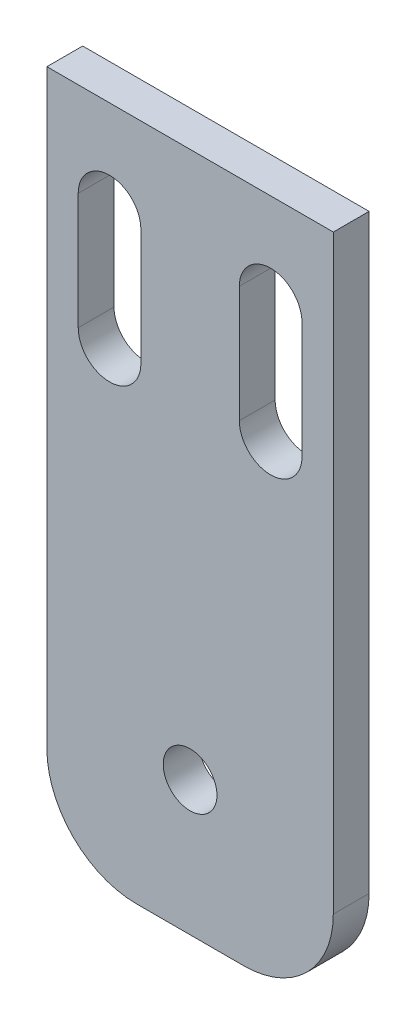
ISO-10303-21;
HEADER;
FILE_DESCRIPTION(('STEP AP214'),'2;1');
FILE_NAME('part.step','',(''),(''),'','','');
FILE_SCHEMA(('AUTOMOTIVE_DESIGN { 1 0 10303 214 1 1 1 1 }'));
ENDSEC;
DATA;
#1=APPLICATION_CONTEXT('core data for automotive mechanical design processes');
#2=APPLICATION_PROTOCOL_DEFINITION('international standard','automotive_design',2000,#1);
#3=PRODUCT_CONTEXT('',#1,'mechanical');
#4=PRODUCT('Part','Part','',(#3));
#5=PRODUCT_RELATED_PRODUCT_CATEGORY('part','',(#4));
#6=PRODUCT_DEFINITION_FORMATION('','',#4);
#7=PRODUCT_DEFINITION_CONTEXT('part definition',#1,'design');
#8=PRODUCT_DEFINITION('design','',#6,#7);
#9=PRODUCT_DEFINITION_SHAPE('','',#8);
#10=(LENGTH_UNIT() NAMED_UNIT(*) SI_UNIT(.MILLI.,.METRE.));
#11=(NAMED_UNIT(*) PLANE_ANGLE_UNIT() SI_UNIT($,.RADIAN.));
#12=(NAMED_UNIT(*) SI_UNIT($,.STERADIAN.) SOLID_ANGLE_UNIT());
#13=UNCERTAINTY_MEASURE_WITH_UNIT(LENGTH_MEASURE(1.E-05),#10,'distance_accuracy_value','');
#14=(GEOMETRIC_REPRESENTATION_CONTEXT(3) GLOBAL_UNCERTAINTY_ASSIGNED_CONTEXT((#13)) GLOBAL_UNIT_ASSIGNED_CONTEXT((#10,
#11,#12)) REPRESENTATION_CONTEXT('',''));
#15=CARTESIAN_POINT('',(0.,0.,0.));
#16=DIRECTION('',(0.,0.,1.));
#17=DIRECTION('',(1.,0.,0.));
#18=AXIS2_PLACEMENT_3D('',#15,#16,#17);
#19=CARTESIAN_POINT('',(0.,0.,0.));
#20=DIRECTION('',(0.,0.,1.));
#21=DIRECTION('',(1.,0.,0.));
#22=AXIS2_PLACEMENT_3D('',#19,#20,#21);
#23=PLANE('',#22);
#24=CARTESIAN_POINT('',(-3.04760792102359,-53.5,0.));
#25=DIRECTION('',(0.,0.,1.));
#26=DIRECTION('',(1.,0.,0.));
#27=AXIS2_PLACEMENT_3D('',#24,#25,#26);
#28=CIRCLE('',#27,1.49999999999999);
#29=CARTESIAN_POINT('',(-1.5476079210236,-53.5,0.));
#30=VERTEX_POINT('',#29);
#31=EDGE_CURVE('E179',#30,#30,#28,.T.);
#32=ORIENTED_EDGE('',*,*,#31,.F.);
#33=EDGE_LOOP('',(#32));
#34=FACE_BOUND('',#33,.T.);
#35=DIRECTION('',(0.,-1.,0.));
#36=VECTOR('',#35,1.);
#37=CARTESIAN_POINT('',(-11.0476079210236,-23.,0.));
#38=LINE('',#37,#36);
#39=CARTESIAN_POINT('',(-11.0476079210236,-23.,0.));
#40=VERTEX_POINT('',#39);
#41=CARTESIAN_POINT('',(-11.0476079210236,-56.,0.));
#42=VERTEX_POINT('',#41);
#43=EDGE_CURVE('E185',#40,#42,#38,.T.);
#44=ORIENTED_EDGE('',*,*,#43,.T.);
#45=CARTESIAN_POINT('',(-6.04760792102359,-56.,0.));
#46=DIRECTION('',(0.,0.,1.));
#47=DIRECTION('',(1.,0.,0.));
#48=AXIS2_PLACEMENT_3D('',#45,#46,#47);
#49=CIRCLE('',#48,5.);
#50=CARTESIAN_POINT('',(-6.04760792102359,-61.,0.));
#51=VERTEX_POINT('',#50);
#52=EDGE_CURVE('E217',#42,#51,#49,.T.);
#53=ORIENTED_EDGE('',*,*,#52,.T.);
#54=DIRECTION('',(1.,0.,0.));
#55=VECTOR('',#54,1.);
#56=CARTESIAN_POINT('',(-11.0476079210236,-61.,0.));
#57=LINE('',#56,#55);
#58=CARTESIAN_POINT('',(-0.0476079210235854,-61.,0.));
#59=VERTEX_POINT('',#58);
#60=EDGE_CURVE('E201',#51,#59,#57,.T.);
#61=ORIENTED_EDGE('',*,*,#60,.T.);
#62=CARTESIAN_POINT('',(-0.0476079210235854,-56.,0.));
#63=DIRECTION('',(0.,0.,1.));
#64=DIRECTION('',(1.,0.,0.));
#65=AXIS2_PLACEMENT_3D('',#62,#63,#64);
#66=CIRCLE('',#65,5.);
#67=CARTESIAN_POINT('',(4.95239207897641,-56.,0.));
#68=VERTEX_POINT('',#67);
#69=EDGE_CURVE('E215',#59,#68,#66,.T.);
#70=ORIENTED_EDGE('',*,*,#69,.T.);
#71=DIRECTION('',(0.,1.,0.));
#72=VECTOR('',#71,1.);
#73=CARTESIAN_POINT('',(4.95239207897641,-23.,0.));
#74=LINE('',#73,#72);
#75=CARTESIAN_POINT('',(4.95239207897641,-23.,0.));
#76=VERTEX_POINT('',#75);
#77=EDGE_CURVE('E204',#68,#76,#74,.T.);
#78=ORIENTED_EDGE('',*,*,#77,.T.);
#79=DIRECTION('',(-1.,0.,0.));
#80=VECTOR('',#79,1.);
#81=CARTESIAN_POINT('',(-11.0476079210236,-23.,0.));
#82=LINE('',#81,#80);
#83=EDGE_CURVE('E190',#76,#40,#82,.T.);
#84=ORIENTED_EDGE('',*,*,#83,.T.);
#85=EDGE_LOOP('',(#44,#53,#61,#70,#78,#84));
#86=FACE_BOUND('',#85,.T.);
#87=CARTESIAN_POINT('',(1.45239207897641,-28.25,0.));
#88=DIRECTION('',(0.,0.,1.));
#89=DIRECTION('',(1.,0.,0.));
#90=AXIS2_PLACEMENT_3D('',#87,#88,#89);
#91=CIRCLE('',#90,1.75);
#92=CARTESIAN_POINT('',(3.20239207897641,-28.25,0.));
#93=VERTEX_POINT('',#92);
#94=CARTESIAN_POINT('',(-0.297607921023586,-28.25,0.));
#95=VERTEX_POINT('',#94);
#96=EDGE_CURVE('E161',#93,#95,#91,.T.);
#97=ORIENTED_EDGE('',*,*,#96,.F.);
#98=DIRECTION('',(0.,-1.,0.));
#99=VECTOR('',#98,1.);
#100=CARTESIAN_POINT('',(3.20239207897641,-28.25,0.));
#101=LINE('',#100,#99);
#102=CARTESIAN_POINT('',(3.20239207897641,-34.75,0.));
#103=VERTEX_POINT('',#102);
#104=EDGE_CURVE('E155',#93,#103,#101,.T.);
#105=ORIENTED_EDGE('',*,*,#104,.T.);
#106=CARTESIAN_POINT('',(1.45239207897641,-34.75,0.));
#107=DIRECTION('',(0.,0.,1.));
#108=DIRECTION('',(1.,0.,0.));
#109=AXIS2_PLACEMENT_3D('',#106,#107,#108);
#110=CIRCLE('',#109,1.75);
#111=CARTESIAN_POINT('',(-0.297607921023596,-34.75,0.));
#112=VERTEX_POINT('',#111);
#113=EDGE_CURVE('E171',#112,#103,#110,.T.);
#114=ORIENTED_EDGE('',*,*,#113,.F.);
#115=DIRECTION('',(0.,-1.,0.));
#116=VECTOR('',#115,1.);
#117=CARTESIAN_POINT('',(-0.297607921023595,-28.25,0.));
#118=LINE('',#117,#116);
#119=EDGE_CURVE('E147',#95,#112,#118,.T.);
#120=ORIENTED_EDGE('',*,*,#119,.F.);
#121=EDGE_LOOP('',(#97,#105,#114,#120));
#122=FACE_BOUND('',#121,.T.);
#123=CARTESIAN_POINT('',(-7.54760792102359,-28.25,0.));
#124=DIRECTION('',(0.,0.,1.));
#125=DIRECTION('',(1.,0.,0.));
#126=AXIS2_PLACEMENT_3D('',#123,#124,#125);
#127=CIRCLE('',#126,1.75);
#128=CARTESIAN_POINT('',(-5.79760792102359,-28.25,0.));
#129=VERTEX_POINT('',#128);
#130=CARTESIAN_POINT('',(-9.29760792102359,-28.25,0.));
#131=VERTEX_POINT('',#130);
#132=EDGE_CURVE('E39',#129,#131,#127,.T.);
#133=ORIENTED_EDGE('',*,*,#132,.F.);
#134=DIRECTION('',(0.,-1.,0.));
#135=VECTOR('',#134,1.);
#136=CARTESIAN_POINT('',(-5.79760792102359,-28.25,0.));
#137=LINE('',#136,#135);
#138=CARTESIAN_POINT('',(-5.79760792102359,-34.75,0.));
#139=VERTEX_POINT('',#138);
#140=EDGE_CURVE('E120',#129,#139,#137,.T.);
#141=ORIENTED_EDGE('',*,*,#140,.T.);
#142=CARTESIAN_POINT('',(-7.54760792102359,-34.75,0.));
#143=DIRECTION('',(0.,0.,1.));
#144=DIRECTION('',(1.,0.,0.));
#145=AXIS2_PLACEMENT_3D('',#142,#143,#144);
#146=CIRCLE('',#145,1.75);
#147=CARTESIAN_POINT('',(-9.29760792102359,-34.75,0.));
#148=VERTEX_POINT('',#147);
#149=EDGE_CURVE('E142',#148,#139,#146,.T.);
#150=ORIENTED_EDGE('',*,*,#149,.F.);
#151=DIRECTION('',(0.,-1.,0.));
#152=VECTOR('',#151,1.);
#153=CARTESIAN_POINT('',(-9.29760792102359,-28.25,0.));
#154=LINE('',#153,#152);
#155=EDGE_CURVE('E135',#131,#148,#154,.T.);
#156=ORIENTED_EDGE('',*,*,#155,.F.);
#157=EDGE_LOOP('',(#133,#141,#150,#156));
#158=FACE_BOUND('',#157,.T.);
#159=ADVANCED_FACE('F16',(#34,#86,#122,#158),#23,.T.);
#160=CARTESIAN_POINT('',(0.,0.,-2.));
#161=DIRECTION('',(0.,0.,1.));
#162=DIRECTION('',(1.,0.,0.));
#163=AXIS2_PLACEMENT_3D('',#160,#161,#162);
#164=PLANE('',#163);
#165=DIRECTION('',(0.,-1.,0.));
#166=VECTOR('',#165,1.);
#167=CARTESIAN_POINT('',(-9.29760792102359,-28.25,-2.));
#168=LINE('',#167,#166);
#169=CARTESIAN_POINT('',(-9.29760792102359,-28.25,-2.));
#170=VERTEX_POINT('',#169);
#171=CARTESIAN_POINT('',(-9.29760792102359,-34.75,-2.));
#172=VERTEX_POINT('',#171);
#173=EDGE_CURVE('E311',#170,#172,#168,.T.);
#174=ORIENTED_EDGE('',*,*,#173,.T.);
#175=CARTESIAN_POINT('',(-7.54760792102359,-34.75,-2.));
#176=DIRECTION('',(0.,0.,1.));
#177=DIRECTION('',(1.,0.,0.));
#178=AXIS2_PLACEMENT_3D('',#175,#176,#177);
#179=CIRCLE('',#178,1.75);
#180=CARTESIAN_POINT('',(-5.79760792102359,-34.75,-2.));
#181=VERTEX_POINT('',#180);
#182=EDGE_CURVE('E31',#172,#181,#179,.T.);
#183=ORIENTED_EDGE('',*,*,#182,.T.);
#184=DIRECTION('',(0.,-1.,0.));
#185=VECTOR('',#184,1.);
#186=CARTESIAN_POINT('',(-5.79760792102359,-28.25,-2.));
#187=LINE('',#186,#185);
#188=CARTESIAN_POINT('',(-5.79760792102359,-28.25,-2.));
#189=VERTEX_POINT('',#188);
#190=EDGE_CURVE('E128',#189,#181,#187,.T.);
#191=ORIENTED_EDGE('',*,*,#190,.F.);
#192=CARTESIAN_POINT('',(-7.54760792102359,-28.25,-2.));
#193=DIRECTION('',(0.,0.,1.));
#194=DIRECTION('',(1.,0.,0.));
#195=AXIS2_PLACEMENT_3D('',#192,#193,#194);
#196=CIRCLE('',#195,1.75);
#197=EDGE_CURVE('E132',#189,#170,#196,.T.);
#198=ORIENTED_EDGE('',*,*,#197,.T.);
#199=EDGE_LOOP('',(#174,#183,#191,#198));
#200=FACE_BOUND('',#199,.T.);
#201=DIRECTION('',(1.,0.,0.));
#202=VECTOR('',#201,1.);
#203=CARTESIAN_POINT('',(-11.0476079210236,-61.,-2.));
#204=LINE('',#203,#202);
#205=CARTESIAN_POINT('',(-6.04760792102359,-61.,-2.));
#206=VERTEX_POINT('',#205);
#207=CARTESIAN_POINT('',(-0.0476079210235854,-61.,-2.));
#208=VERTEX_POINT('',#207);
#209=EDGE_CURVE('E189',#206,#208,#204,.T.);
#210=ORIENTED_EDGE('',*,*,#209,.F.);
#211=CARTESIAN_POINT('',(-6.04760792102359,-56.,-2.));
#212=DIRECTION('',(0.,0.,1.));
#213=DIRECTION('',(1.,0.,0.));
#214=AXIS2_PLACEMENT_3D('',#211,#212,#213);
#215=CIRCLE('',#214,5.);
#216=CARTESIAN_POINT('',(-11.0476079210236,-56.,-2.));
#217=VERTEX_POINT('',#216);
#218=EDGE_CURVE('E24',#206,#217,#215,.F.);
#219=ORIENTED_EDGE('',*,*,#218,.T.);
#220=DIRECTION('',(0.,-1.,0.));
#221=VECTOR('',#220,1.);
#222=CARTESIAN_POINT('',(-11.0476079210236,-23.,-2.));
#223=LINE('',#222,#221);
#224=CARTESIAN_POINT('',(-11.0476079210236,-23.,-2.));
#225=VERTEX_POINT('',#224);
#226=EDGE_CURVE('E186',#225,#217,#223,.T.);
#227=ORIENTED_EDGE('',*,*,#226,.F.);
#228=DIRECTION('',(-1.,0.,0.));
#229=VECTOR('',#228,1.);
#230=CARTESIAN_POINT('',(-11.0476079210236,-23.,-2.));
#231=LINE('',#230,#229);
#232=CARTESIAN_POINT('',(4.95239207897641,-23.,-2.));
#233=VERTEX_POINT('',#232);
#234=EDGE_CURVE('E195',#233,#225,#231,.T.);
#235=ORIENTED_EDGE('',*,*,#234,.F.);
#236=DIRECTION('',(0.,1.,0.));
#237=VECTOR('',#236,1.);
#238=CARTESIAN_POINT('',(4.95239207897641,-23.,-2.));
#239=LINE('',#238,#237);
#240=CARTESIAN_POINT('',(4.95239207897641,-56.,-2.));
#241=VERTEX_POINT('',#240);
#242=EDGE_CURVE('E193',#241,#233,#239,.T.);
#243=ORIENTED_EDGE('',*,*,#242,.F.);
#244=CARTESIAN_POINT('',(-0.0476079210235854,-56.,-2.));
#245=DIRECTION('',(0.,0.,1.));
#246=DIRECTION('',(1.,0.,0.));
#247=AXIS2_PLACEMENT_3D('',#244,#245,#246);
#248=CIRCLE('',#247,5.);
#249=EDGE_CURVE('E224',#241,#208,#248,.F.);
#250=ORIENTED_EDGE('',*,*,#249,.T.);
#251=EDGE_LOOP('',(#210,#219,#227,#235,#243,#250));
#252=FACE_BOUND('',#251,.T.);
#253=CARTESIAN_POINT('',(-3.04760792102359,-53.5,-2.));
#254=DIRECTION('',(0.,0.,1.));
#255=DIRECTION('',(1.,0.,0.));
#256=AXIS2_PLACEMENT_3D('',#253,#254,#255);
#257=CIRCLE('',#256,1.5);
#258=CARTESIAN_POINT('',(-1.54760792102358,-53.5,-2.));
#259=VERTEX_POINT('',#258);
#260=EDGE_CURVE('E182',#259,#259,#257,.T.);
#261=ORIENTED_EDGE('',*,*,#260,.T.);
#262=EDGE_LOOP('',(#261));
#263=FACE_BOUND('',#262,.T.);
#264=DIRECTION('',(0.,-1.,0.));
#265=VECTOR('',#264,1.);
#266=CARTESIAN_POINT('',(3.20239207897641,-28.25,-2.));
#267=LINE('',#266,#265);
#268=CARTESIAN_POINT('',(3.20239207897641,-28.25,-2.));
#269=VERTEX_POINT('',#268);
#270=CARTESIAN_POINT('',(3.20239207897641,-34.75,-2.));
#271=VERTEX_POINT('',#270);
#272=EDGE_CURVE('E152',#269,#271,#267,.T.);
#273=ORIENTED_EDGE('',*,*,#272,.F.);
#274=CARTESIAN_POINT('',(1.45239207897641,-28.25,-2.));
#275=DIRECTION('',(0.,0.,1.));
#276=DIRECTION('',(1.,0.,0.));
#277=AXIS2_PLACEMENT_3D('',#274,#275,#276);
#278=CIRCLE('',#277,1.75);
#279=CARTESIAN_POINT('',(-0.297607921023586,-28.25,-2.));
#280=VERTEX_POINT('',#279);
#281=EDGE_CURVE('E163',#269,#280,#278,.T.);
#282=ORIENTED_EDGE('',*,*,#281,.T.);
#283=DIRECTION('',(0.,-1.,0.));
#284=VECTOR('',#283,1.);
#285=CARTESIAN_POINT('',(-0.297607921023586,-28.25,-2.));
#286=LINE('',#285,#284);
#287=CARTESIAN_POINT('',(-0.297607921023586,-34.75,-2.));
#288=VERTEX_POINT('',#287);
#289=EDGE_CURVE('E149',#280,#288,#286,.T.);
#290=ORIENTED_EDGE('',*,*,#289,.T.);
#291=CARTESIAN_POINT('',(1.45239207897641,-34.75,-2.));
#292=DIRECTION('',(0.,0.,1.));
#293=DIRECTION('',(1.,0.,0.));
#294=AXIS2_PLACEMENT_3D('',#291,#292,#293);
#295=CIRCLE('',#294,1.75);
#296=EDGE_CURVE('E173',#288,#271,#295,.T.);
#297=ORIENTED_EDGE('',*,*,#296,.T.);
#298=EDGE_LOOP('',(#273,#282,#290,#297));
#299=FACE_BOUND('',#298,.T.);
#300=ADVANCED_FACE('F229',(#200,#252,#263,#299),#164,.F.);
#301=CARTESIAN_POINT('',(-11.0476079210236,-23.,-2.));
#302=DIRECTION('',(-1.,0.,0.));
#303=DIRECTION('',(0.,-1.,0.));
#304=AXIS2_PLACEMENT_3D('',#301,#302,#303);
#305=PLANE('',#304);
#306=ORIENTED_EDGE('',*,*,#226,.T.);
#307=DIRECTION('',(0.,0.,1.));
#308=VECTOR('',#307,1.);
#309=CARTESIAN_POINT('',(-11.0476079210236,-56.,-2.));
#310=LINE('',#309,#308);
#311=EDGE_CURVE('E210',#217,#42,#310,.T.);
#312=ORIENTED_EDGE('',*,*,#311,.T.);
#313=ORIENTED_EDGE('',*,*,#43,.F.);
#314=DIRECTION('',(0.,0.,1.));
#315=VECTOR('',#314,1.);
#316=CARTESIAN_POINT('',(-11.0476079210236,-23.,-2.));
#317=LINE('',#316,#315);
#318=EDGE_CURVE('E208',#225,#40,#317,.T.);
#319=ORIENTED_EDGE('',*,*,#318,.F.);
#320=EDGE_LOOP('',(#306,#312,#313,#319));
#321=FACE_BOUND('',#320,.T.);
#322=ADVANCED_FACE('F236',(#321),#305,.T.);
#323=CARTESIAN_POINT('',(-11.0476079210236,-23.,-2.));
#324=DIRECTION('',(0.,1.,0.));
#325=DIRECTION('',(0.,0.,1.));
#326=AXIS2_PLACEMENT_3D('',#323,#324,#325);
#327=PLANE('',#326);
#328=ORIENTED_EDGE('',*,*,#83,.F.);
#329=DIRECTION('',(0.,0.,1.));
#330=VECTOR('',#329,1.);
#331=CARTESIAN_POINT('',(4.95239207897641,-23.,-2.));
#332=LINE('',#331,#330);
#333=EDGE_CURVE('E198',#233,#76,#332,.T.);
#334=ORIENTED_EDGE('',*,*,#333,.F.);
#335=ORIENTED_EDGE('',*,*,#234,.T.);
#336=ORIENTED_EDGE('',*,*,#318,.T.);
#337=EDGE_LOOP('',(#328,#334,#335,#336));
#338=FACE_BOUND('',#337,.T.);
#339=ADVANCED_FACE('F255',(#338),#327,.T.);
#340=CARTESIAN_POINT('',(4.95239207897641,-23.,-2.));
#341=DIRECTION('',(1.,0.,0.));
#342=DIRECTION('',(0.,1.,0.));
#343=AXIS2_PLACEMENT_3D('',#340,#341,#342);
#344=PLANE('',#343);
#345=ORIENTED_EDGE('',*,*,#77,.F.);
#346=DIRECTION('',(0.,0.,1.));
#347=VECTOR('',#346,1.);
#348=CARTESIAN_POINT('',(4.95239207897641,-56.,-2.));
#349=LINE('',#348,#347);
#350=EDGE_CURVE('E11',#68,#241,#349,.F.);
#351=ORIENTED_EDGE('',*,*,#350,.T.);
#352=ORIENTED_EDGE('',*,*,#242,.T.);
#353=ORIENTED_EDGE('',*,*,#333,.T.);
#354=EDGE_LOOP('',(#345,#351,#352,#353));
#355=FACE_BOUND('',#354,.T.);
#356=ADVANCED_FACE('F250',(#355),#344,.T.);
#357=CARTESIAN_POINT('',(-11.0476079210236,-61.,-2.));
#358=DIRECTION('',(0.,-1.,0.));
#359=DIRECTION('',(0.,0.,-1.));
#360=AXIS2_PLACEMENT_3D('',#357,#358,#359);
#361=PLANE('',#360);
#362=ORIENTED_EDGE('',*,*,#60,.F.);
#363=DIRECTION('',(0.,0.,1.));
#364=VECTOR('',#363,1.);
#365=CARTESIAN_POINT('',(-6.04760792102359,-61.,-2.));
#366=LINE('',#365,#364);
#367=EDGE_CURVE('E222',#51,#206,#366,.F.);
#368=ORIENTED_EDGE('',*,*,#367,.T.);
#369=ORIENTED_EDGE('',*,*,#209,.T.);
#370=DIRECTION('',(0.,0.,1.));
#371=VECTOR('',#370,1.);
#372=CARTESIAN_POINT('',(-0.0476079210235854,-61.,-2.));
#373=LINE('',#372,#371);
#374=EDGE_CURVE('E219',#208,#59,#373,.T.);
#375=ORIENTED_EDGE('',*,*,#374,.T.);
#376=EDGE_LOOP('',(#362,#368,#369,#375));
#377=FACE_BOUND('',#376,.T.);
#378=ADVANCED_FACE('F243',(#377),#361,.T.);
#379=CARTESIAN_POINT('',(-3.04760792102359,-53.5,0.));
#380=DIRECTION('',(0.,0.,1.));
#381=DIRECTION('',(1.,0.,0.));
#382=AXIS2_PLACEMENT_3D('',#379,#380,#381);
#383=CYLINDRICAL_SURFACE('',#382,1.5);
#384=ORIENTED_EDGE('',*,*,#260,.F.);
#385=EDGE_LOOP('',(#384));
#386=FACE_BOUND('',#385,.T.);
#387=ORIENTED_EDGE('',*,*,#31,.T.);
#388=EDGE_LOOP('',(#387));
#389=FACE_BOUND('',#388,.T.);
#390=ADVANCED_FACE('F277',(#386,#389),#383,.F.);
#391=CARTESIAN_POINT('',(-6.04760792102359,-56.,-2.));
#392=DIRECTION('',(0.,0.,1.));
#393=DIRECTION('',(1.,0.,0.));
#394=AXIS2_PLACEMENT_3D('',#391,#392,#393);
#395=CYLINDRICAL_SURFACE('',#394,5.);
#396=ORIENTED_EDGE('',*,*,#218,.F.);
#397=ORIENTED_EDGE('',*,*,#367,.F.);
#398=ORIENTED_EDGE('',*,*,#52,.F.);
#399=ORIENTED_EDGE('',*,*,#311,.F.);
#400=EDGE_LOOP('',(#396,#397,#398,#399));
#401=FACE_BOUND('',#400,.T.);
#402=ADVANCED_FACE('F238',(#401),#395,.T.);
#403=CARTESIAN_POINT('',(-0.0476079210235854,-56.,-2.));
#404=DIRECTION('',(0.,0.,1.));
#405=DIRECTION('',(1.,0.,0.));
#406=AXIS2_PLACEMENT_3D('',#403,#404,#405);
#407=CYLINDRICAL_SURFACE('',#406,5.);
#408=ORIENTED_EDGE('',*,*,#249,.F.);
#409=ORIENTED_EDGE('',*,*,#350,.F.);
#410=ORIENTED_EDGE('',*,*,#69,.F.);
#411=ORIENTED_EDGE('',*,*,#374,.F.);
#412=EDGE_LOOP('',(#408,#409,#410,#411));
#413=FACE_BOUND('',#412,.T.);
#414=ADVANCED_FACE('F18',(#413),#407,.T.);
#415=CARTESIAN_POINT('',(1.45239207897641,-34.75,0.));
#416=DIRECTION('',(0.,0.,1.));
#417=DIRECTION('',(1.,0.,0.));
#418=AXIS2_PLACEMENT_3D('',#415,#416,#417);
#419=CYLINDRICAL_SURFACE('',#418,1.75);
#420=ORIENTED_EDGE('',*,*,#113,.T.);
#421=DIRECTION('',(0.,0.,-1.));
#422=VECTOR('',#421,1.);
#423=CARTESIAN_POINT('',(3.20239207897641,-34.75,-2.));
#424=LINE('',#423,#422);
#425=EDGE_CURVE('E169',#103,#271,#424,.T.);
#426=ORIENTED_EDGE('',*,*,#425,.T.);
#427=ORIENTED_EDGE('',*,*,#296,.F.);
#428=DIRECTION('',(0.,0.,1.));
#429=VECTOR('',#428,1.);
#430=CARTESIAN_POINT('',(-0.297607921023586,-34.75,0.));
#431=LINE('',#430,#429);
#432=EDGE_CURVE('E176',#112,#288,#431,.F.);
#433=ORIENTED_EDGE('',*,*,#432,.F.);
#434=EDGE_LOOP('',(#420,#426,#427,#433));
#435=FACE_BOUND('',#434,.T.);
#436=ADVANCED_FACE('F281',(#435),#419,.F.);
#437=CARTESIAN_POINT('',(1.45239207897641,-28.25,0.));
#438=DIRECTION('',(0.,0.,1.));
#439=DIRECTION('',(1.,0.,0.));
#440=AXIS2_PLACEMENT_3D('',#437,#438,#439);
#441=CYLINDRICAL_SURFACE('',#440,1.75);
#442=ORIENTED_EDGE('',*,*,#281,.F.);
#443=DIRECTION('',(0.,0.,-1.));
#444=VECTOR('',#443,1.);
#445=CARTESIAN_POINT('',(3.20239207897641,-28.25,-2.));
#446=LINE('',#445,#444);
#447=EDGE_CURVE('E158',#93,#269,#446,.T.);
#448=ORIENTED_EDGE('',*,*,#447,.F.);
#449=ORIENTED_EDGE('',*,*,#96,.T.);
#450=DIRECTION('',(0.,0.,1.));
#451=VECTOR('',#450,1.);
#452=CARTESIAN_POINT('',(-0.297607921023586,-28.25,0.));
#453=LINE('',#452,#451);
#454=EDGE_CURVE('E166',#280,#95,#453,.T.);
#455=ORIENTED_EDGE('',*,*,#454,.F.);
#456=EDGE_LOOP('',(#442,#448,#449,#455));
#457=FACE_BOUND('',#456,.T.);
#458=ADVANCED_FACE('F284',(#457),#441,.F.);
#459=CARTESIAN_POINT('',(3.20239207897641,-28.25,-2.));
#460=DIRECTION('',(-1.,0.,0.));
#461=DIRECTION('',(0.,0.,1.));
#462=AXIS2_PLACEMENT_3D('',#459,#460,#461);
#463=PLANE('',#462);
#464=ORIENTED_EDGE('',*,*,#425,.F.);
#465=ORIENTED_EDGE('',*,*,#104,.F.);
#466=ORIENTED_EDGE('',*,*,#447,.T.);
#467=ORIENTED_EDGE('',*,*,#272,.T.);
#468=EDGE_LOOP('',(#464,#465,#466,#467));
#469=FACE_BOUND('',#468,.T.);
#470=ADVANCED_FACE('F288',(#469),#463,.T.);
#471=CARTESIAN_POINT('',(-0.297607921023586,-28.25,0.));
#472=DIRECTION('',(-1.,0.,0.));
#473=DIRECTION('',(0.,-1.,0.));
#474=AXIS2_PLACEMENT_3D('',#471,#472,#473);
#475=PLANE('',#474);
#476=ORIENTED_EDGE('',*,*,#432,.T.);
#477=ORIENTED_EDGE('',*,*,#289,.F.);
#478=ORIENTED_EDGE('',*,*,#454,.T.);
#479=ORIENTED_EDGE('',*,*,#119,.T.);
#480=EDGE_LOOP('',(#476,#477,#478,#479));
#481=FACE_BOUND('',#480,.T.);
#482=ADVANCED_FACE('F292',(#481),#475,.F.);
#483=CARTESIAN_POINT('',(-7.54760792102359,-34.75,0.));
#484=DIRECTION('',(0.,0.,1.));
#485=DIRECTION('',(1.,0.,0.));
#486=AXIS2_PLACEMENT_3D('',#483,#484,#485);
#487=CYLINDRICAL_SURFACE('',#486,1.75);
#488=ORIENTED_EDGE('',*,*,#149,.T.);
#489=DIRECTION('',(0.,0.,-1.));
#490=VECTOR('',#489,1.);
#491=CARTESIAN_POINT('',(-5.79760792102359,-34.75,-2.));
#492=LINE('',#491,#490);
#493=EDGE_CURVE('E125',#139,#181,#492,.T.);
#494=ORIENTED_EDGE('',*,*,#493,.T.);
#495=ORIENTED_EDGE('',*,*,#182,.F.);
#496=DIRECTION('',(0.,0.,1.));
#497=VECTOR('',#496,1.);
#498=CARTESIAN_POINT('',(-9.29760792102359,-34.75,0.));
#499=LINE('',#498,#497);
#500=EDGE_CURVE('E145',#148,#172,#499,.F.);
#501=ORIENTED_EDGE('',*,*,#500,.F.);
#502=EDGE_LOOP('',(#488,#494,#495,#501));
#503=FACE_BOUND('',#502,.T.);
#504=ADVANCED_FACE('F296',(#503),#487,.F.);
#505=CARTESIAN_POINT('',(-7.54760792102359,-28.25,0.));
#506=DIRECTION('',(0.,0.,1.));
#507=DIRECTION('',(1.,0.,0.));
#508=AXIS2_PLACEMENT_3D('',#505,#506,#507);
#509=CYLINDRICAL_SURFACE('',#508,1.75);
#510=ORIENTED_EDGE('',*,*,#197,.F.);
#511=DIRECTION('',(0.,0.,-1.));
#512=VECTOR('',#511,1.);
#513=CARTESIAN_POINT('',(-5.79760792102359,-28.25,-2.));
#514=LINE('',#513,#512);
#515=EDGE_CURVE('E123',#129,#189,#514,.T.);
#516=ORIENTED_EDGE('',*,*,#515,.F.);
#517=ORIENTED_EDGE('',*,*,#132,.T.);
#518=DIRECTION('',(0.,0.,1.));
#519=VECTOR('',#518,1.);
#520=CARTESIAN_POINT('',(-9.29760792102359,-28.25,0.));
#521=LINE('',#520,#519);
#522=EDGE_CURVE('E137',#170,#131,#521,.T.);
#523=ORIENTED_EDGE('',*,*,#522,.F.);
#524=EDGE_LOOP('',(#510,#516,#517,#523));
#525=FACE_BOUND('',#524,.T.);
#526=ADVANCED_FACE('F130',(#525),#509,.F.);
#527=CARTESIAN_POINT('',(-5.79760792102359,-28.25,-2.));
#528=DIRECTION('',(-1.,0.,0.));
#529=DIRECTION('',(0.,0.,1.));
#530=AXIS2_PLACEMENT_3D('',#527,#528,#529);
#531=PLANE('',#530);
#532=ORIENTED_EDGE('',*,*,#493,.F.);
#533=ORIENTED_EDGE('',*,*,#140,.F.);
#534=ORIENTED_EDGE('',*,*,#515,.T.);
#535=ORIENTED_EDGE('',*,*,#190,.T.);
#536=EDGE_LOOP('',(#532,#533,#534,#535));
#537=FACE_BOUND('',#536,.T.);
#538=ADVANCED_FACE('F121',(#537),#531,.T.);
#539=CARTESIAN_POINT('',(-9.29760792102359,-28.25,0.));
#540=DIRECTION('',(-1.,0.,0.));
#541=DIRECTION('',(0.,0.,1.));
#542=AXIS2_PLACEMENT_3D('',#539,#540,#541);
#543=PLANE('',#542);
#544=ORIENTED_EDGE('',*,*,#500,.T.);
#545=ORIENTED_EDGE('',*,*,#173,.F.);
#546=ORIENTED_EDGE('',*,*,#522,.T.);
#547=ORIENTED_EDGE('',*,*,#155,.T.);
#548=EDGE_LOOP('',(#544,#545,#546,#547));
#549=FACE_BOUND('',#548,.T.);
#550=ADVANCED_FACE('F304',(#549),#543,.F.);
#551=CLOSED_SHELL('',(#159,#300,#322,#339,#356,#378,#390,#402,#414,#436,#458,#470,#482,#504,
#526,#538,#550));
#552=MANIFOLD_SOLID_BREP('B1',#551);
#553=ADVANCED_BREP_SHAPE_REPRESENTATION('',(#18,#552),#14);
#554=SHAPE_DEFINITION_REPRESENTATION(#9,#553);
ENDSEC;
END-ISO-10303-21;
